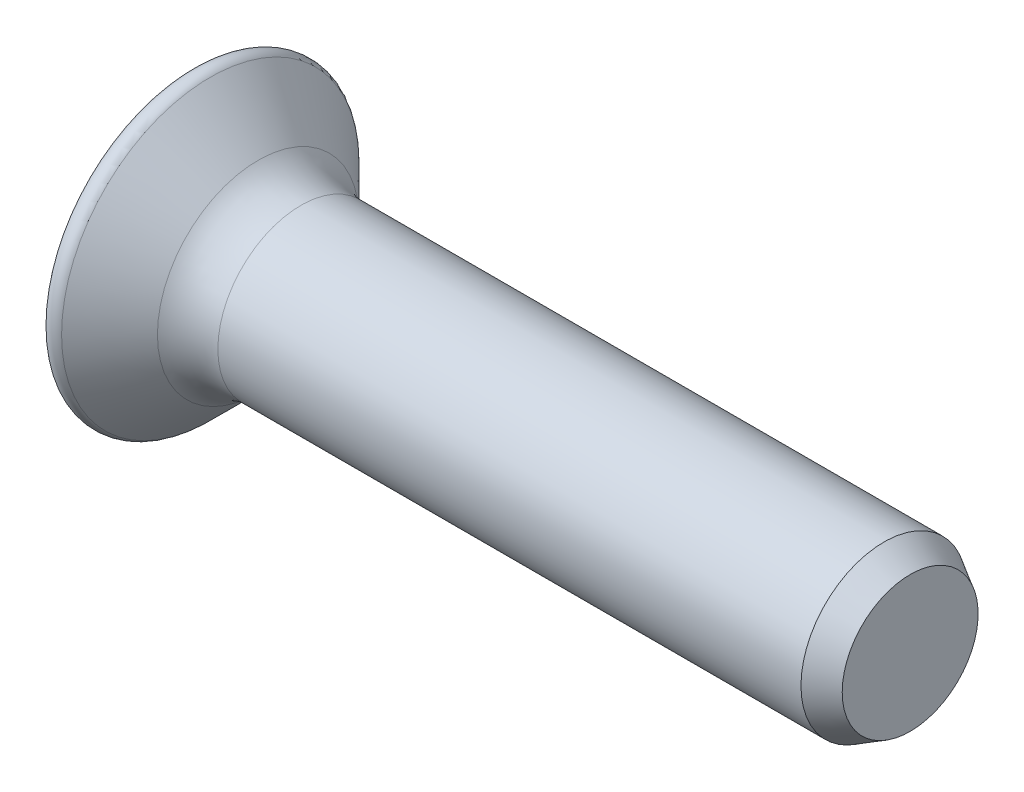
from build123d import *

# Parameters (mm, degrees)
CHAMFER1_SIZE      = 0.2
CHAMFER1_SIZE2     = 0.346410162
CUT_EXTRUDE1_DEPTH = 0.8
CUT_EXTRUDE1_TAPER = 6
FILLET1_R          = 0.8


with BuildPart() as part:
    # Sketch1 → Revolve1 (revolve)
    with BuildSketch(Plane.XY, mode=Mode.PRIVATE) as revolve1_sk:
        with BuildLine():
            Line((-1.6, 0), (8.4, 0))
            Line((8.4, 0), (8.4, 1.1))
            Line((8.4, 1.1), (0, 1.1))
            Line((0, 1.1), (-0.869043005, 1.969043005))
            ThreePointArc((-0.869043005, 1.969043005), (-0.992640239, 2.010371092), (-1.1, 1.936491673))
            ThreePointArc((-1.1, 1.936491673), (-1.472983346, 1), (-1.6, 0))
        make_face()
    revolve(revolve1_sk.sketch.rotate(Axis((0, 0, 0), (1, 0, 0)), 90), axis=Axis((0, 0, 0), (1, 0, 0)))

    # Chamfer1
    chamfer1_edges = [part.edges().sort_by_distance(p)[0] for p in [
        (8.4, 0, -1.1),
    ]]
    chamfer1_side = [part.faces().sort_by_distance(p)[0] for p in [
        (8.4, 0, 0),
    ]]
    chamfer(chamfer1_edges, length=CHAMFER1_SIZE, length2=CHAMFER1_SIZE2, reference=chamfer1_side[0])

    # Sketch3 → Cut-Extrude1 (cut)
    with BuildSketch(Plane(origin=(-1.6, 0, 0), x_dir=(0, 0, -1), z_dir=(1, 0, 0))):
        Polygon((-0.22, 1.1), (-0.146666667, 0.733333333), (-0.36140157, 0.36140157), (-0.733333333, 0.146666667), (-1.1, 0.22), (-1.1, -0.22), (-0.733333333, -0.146666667), (-0.36140157, -0.36140157), (-0.146666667, -0.733333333), (-0.22, -1.1), (0.22, -1.1), (0.146666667, -0.733333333), (0.36140157, -0.36140157), (0.733333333, -0.146666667), (1.1, -0.22), (1.1, 0.22), (0.733333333, 0.146666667), (0.36140157, 0.36140157), (0.146666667, 0.733333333), (0.22, 1.1), align=None)
    extrude(amount=CUT_EXTRUDE1_DEPTH, taper=CUT_EXTRUDE1_TAPER, mode=Mode.SUBTRACT)

    # Fillet1
    fillet1_edges = [part.edges().sort_by_distance(p)[0] for p in [
        (0, 0, -1.1),
    ]]
    fillet(fillet1_edges, radius=FILLET1_R)


solid = part.part
